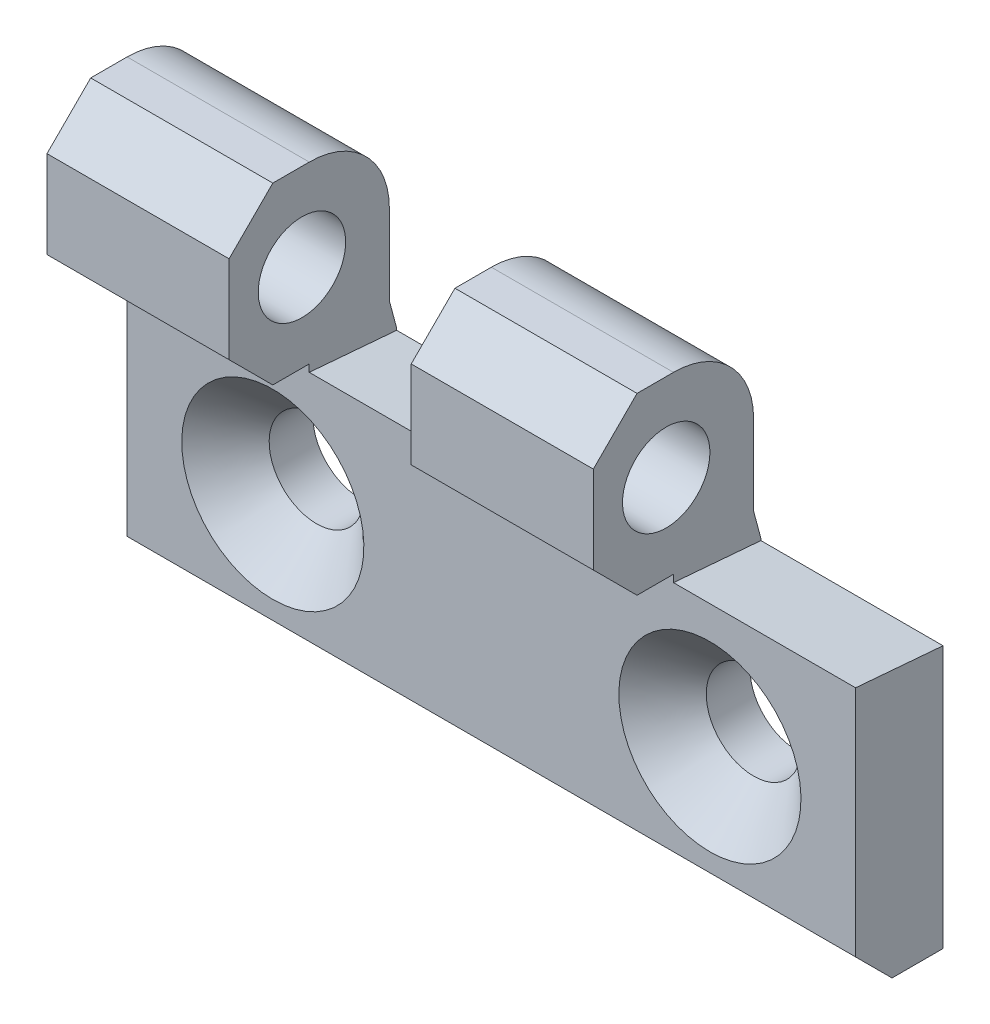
ISO-10303-21;
HEADER;
FILE_DESCRIPTION(('STEP AP214'),'2;1');
FILE_NAME('part.step','',(''),(''),'','','');
FILE_SCHEMA(('AUTOMOTIVE_DESIGN { 1 0 10303 214 1 1 1 1 }'));
ENDSEC;
DATA;
#1=APPLICATION_CONTEXT('core data for automotive mechanical design processes');
#2=APPLICATION_PROTOCOL_DEFINITION('international standard','automotive_design',2000,#1);
#3=PRODUCT_CONTEXT('',#1,'mechanical');
#4=PRODUCT('Part','Part','',(#3));
#5=PRODUCT_RELATED_PRODUCT_CATEGORY('part','',(#4));
#6=PRODUCT_DEFINITION_FORMATION('','',#4);
#7=PRODUCT_DEFINITION_CONTEXT('part definition',#1,'design');
#8=PRODUCT_DEFINITION('design','',#6,#7);
#9=PRODUCT_DEFINITION_SHAPE('','',#8);
#10=(LENGTH_UNIT() NAMED_UNIT(*) SI_UNIT(.MILLI.,.METRE.));
#11=(NAMED_UNIT(*) PLANE_ANGLE_UNIT() SI_UNIT($,.RADIAN.));
#12=(NAMED_UNIT(*) SI_UNIT($,.STERADIAN.) SOLID_ANGLE_UNIT());
#13=UNCERTAINTY_MEASURE_WITH_UNIT(LENGTH_MEASURE(1.E-05),#10,'distance_accuracy_value','');
#14=(GEOMETRIC_REPRESENTATION_CONTEXT(3) GLOBAL_UNCERTAINTY_ASSIGNED_CONTEXT((#13)) GLOBAL_UNIT_ASSIGNED_CONTEXT((#10,
#11,#12)) REPRESENTATION_CONTEXT('',''));
#15=CARTESIAN_POINT('',(0.,0.,0.));
#16=DIRECTION('',(0.,0.,1.));
#17=DIRECTION('',(1.,0.,0.));
#18=AXIS2_PLACEMENT_3D('',#15,#16,#17);
#19=CARTESIAN_POINT('',(-10.,8.,0.));
#20=DIRECTION('',(0.,0.99654575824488,-0.0830454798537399));
#21=DIRECTION('',(0.,0.0830454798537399,0.99654575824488));
#22=AXIS2_PLACEMENT_3D('',#19,#20,#21);
#23=PLANE('',#22);
#24=DIRECTION('',(0.,-0.0830454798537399,-0.99654575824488));
#25=VECTOR('',#24,1.);
#26=CARTESIAN_POINT('',(2.5,8.,0.));
#27=LINE('',#26,#25);
#28=CARTESIAN_POINT('',(2.5,8.5,6.));
#29=VERTEX_POINT('',#28);
#30=CARTESIAN_POINT('',(2.5,8.,0.));
#31=VERTEX_POINT('',#30);
#32=EDGE_CURVE('E29',#29,#31,#27,.T.);
#33=ORIENTED_EDGE('',*,*,#32,.F.);
#34=DIRECTION('',(1.,0.,0.));
#35=VECTOR('',#34,1.);
#36=CARTESIAN_POINT('',(-10.,8.5,6.));
#37=LINE('',#36,#35);
#38=CARTESIAN_POINT('',(15.,8.5,6.));
#39=VERTEX_POINT('',#38);
#40=EDGE_CURVE('E401',#29,#39,#37,.T.);
#41=ORIENTED_EDGE('',*,*,#40,.T.);
#42=DIRECTION('',(0.,-0.0830454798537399,-0.99654575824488));
#43=VECTOR('',#42,1.);
#44=CARTESIAN_POINT('',(15.,8.,0.));
#45=LINE('',#44,#43);
#46=CARTESIAN_POINT('',(15.,8.,0.));
#47=VERTEX_POINT('',#46);
#48=EDGE_CURVE('E367',#39,#47,#45,.T.);
#49=ORIENTED_EDGE('',*,*,#48,.T.);
#50=DIRECTION('',(1.,0.,0.));
#51=VECTOR('',#50,1.);
#52=CARTESIAN_POINT('',(-10.,8.,0.));
#53=LINE('',#52,#51);
#54=EDGE_CURVE('E22',#31,#47,#53,.T.);
#55=ORIENTED_EDGE('',*,*,#54,.F.);
#56=EDGE_LOOP('',(#33,#41,#49,#55));
#57=FACE_BOUND('',#56,.T.);
#58=ADVANCED_FACE('F14',(#57),#23,.T.);
#59=CARTESIAN_POINT('',(-10.,-10.,3.5));
#60=DIRECTION('',(0.,-1.,0.));
#61=DIRECTION('',(1.,0.,0.));
#62=AXIS2_PLACEMENT_3D('',#59,#60,#61);
#63=PLANE('',#62);
#64=DIRECTION('',(1.,0.,0.));
#65=VECTOR('',#64,1.);
#66=CARTESIAN_POINT('',(-10.,-10.,0.));
#67=LINE('',#66,#65);
#68=CARTESIAN_POINT('',(-10.,-10.,0.));
#69=VERTEX_POINT('',#68);
#70=CARTESIAN_POINT('',(40.,-10.,0.));
#71=VERTEX_POINT('',#70);
#72=EDGE_CURVE('E9',#69,#71,#67,.T.);
#73=ORIENTED_EDGE('',*,*,#72,.T.);
#74=DIRECTION('',(0.,0.,-1.));
#75=VECTOR('',#74,1.);
#76=CARTESIAN_POINT('',(40.,-10.,3.5));
#77=LINE('',#76,#75);
#78=CARTESIAN_POINT('',(40.,-10.,3.5));
#79=VERTEX_POINT('',#78);
#80=EDGE_CURVE('E372',#79,#71,#77,.T.);
#81=ORIENTED_EDGE('',*,*,#80,.F.);
#82=DIRECTION('',(1.,0.,0.));
#83=VECTOR('',#82,1.);
#84=CARTESIAN_POINT('',(-10.,-10.,3.5));
#85=LINE('',#84,#83);
#86=CARTESIAN_POINT('',(-10.,-10.,3.5));
#87=VERTEX_POINT('',#86);
#88=EDGE_CURVE('E394',#87,#79,#85,.T.);
#89=ORIENTED_EDGE('',*,*,#88,.F.);
#90=DIRECTION('',(0.,0.,-1.));
#91=VECTOR('',#90,1.);
#92=CARTESIAN_POINT('',(-10.,-10.,3.5));
#93=LINE('',#92,#91);
#94=EDGE_CURVE('E385',#87,#69,#93,.T.);
#95=ORIENTED_EDGE('',*,*,#94,.T.);
#96=EDGE_LOOP('',(#73,#81,#89,#95));
#97=FACE_BOUND('',#96,.T.);
#98=ADVANCED_FACE('F16',(#97),#63,.T.);
#99=CARTESIAN_POINT('',(-10.,-10.,0.));
#100=DIRECTION('',(0.,0.,-1.));
#101=DIRECTION('',(-1.,0.,0.));
#102=AXIS2_PLACEMENT_3D('',#99,#100,#101);
#103=PLANE('',#102);
#104=CARTESIAN_POINT('',(0.,0.,0.));
#105=DIRECTION('',(0.,0.,1.));
#106=DIRECTION('',(0.,-1.,0.));
#107=AXIS2_PLACEMENT_3D('',#104,#105,#106);
#108=CIRCLE('',#107,3.25);
#109=CARTESIAN_POINT('',(0.,-3.25,0.));
#110=VERTEX_POINT('',#109);
#111=EDGE_CURVE('E536',#110,#110,#108,.T.);
#112=ORIENTED_EDGE('',*,*,#111,.T.);
#113=EDGE_LOOP('',(#112));
#114=FACE_BOUND('',#113,.T.);
#115=CARTESIAN_POINT('',(30.,0.,0.));
#116=DIRECTION('',(0.,0.,1.));
#117=DIRECTION('',(0.,-1.,0.));
#118=AXIS2_PLACEMENT_3D('',#115,#116,#117);
#119=CIRCLE('',#118,3.25);
#120=CARTESIAN_POINT('',(30.,-3.25,0.));
#121=VERTEX_POINT('',#120);
#122=EDGE_CURVE('E539',#121,#121,#119,.T.);
#123=ORIENTED_EDGE('',*,*,#122,.T.);
#124=EDGE_LOOP('',(#123));
#125=FACE_BOUND('',#124,.T.);
#126=DIRECTION('',(0.,1.,0.));
#127=VECTOR('',#126,1.);
#128=CARTESIAN_POINT('',(-10.,-10.,0.));
#129=LINE('',#128,#127);
#130=CARTESIAN_POINT('',(-10.,8.1339745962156,0.));
#131=VERTEX_POINT('',#130);
#132=EDGE_CURVE('E192',#69,#131,#129,.T.);
#133=ORIENTED_EDGE('',*,*,#132,.T.);
#134=DIRECTION('',(1.,0.,0.));
#135=VECTOR('',#134,1.);
#136=CARTESIAN_POINT('',(-10.,8.1339745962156,0.));
#137=LINE('',#136,#135);
#138=CARTESIAN_POINT('',(2.5,8.1339745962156,0.));
#139=VERTEX_POINT('',#138);
#140=EDGE_CURVE('E189',#131,#139,#137,.T.);
#141=ORIENTED_EDGE('',*,*,#140,.T.);
#142=DIRECTION('',(0.,1.,0.));
#143=VECTOR('',#142,1.);
#144=CARTESIAN_POINT('',(2.5,3.,0.));
#145=LINE('',#144,#143);
#146=EDGE_CURVE('E178',#31,#139,#145,.T.);
#147=ORIENTED_EDGE('',*,*,#146,.F.);
#148=ORIENTED_EDGE('',*,*,#54,.T.);
#149=DIRECTION('',(0.,1.,0.));
#150=VECTOR('',#149,1.);
#151=CARTESIAN_POINT('',(15.,3.,0.));
#152=LINE('',#151,#150);
#153=CARTESIAN_POINT('',(15.,8.1339745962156,0.));
#154=VERTEX_POINT('',#153);
#155=EDGE_CURVE('E282',#47,#154,#152,.T.);
#156=ORIENTED_EDGE('',*,*,#155,.T.);
#157=DIRECTION('',(-1.,0.,0.));
#158=VECTOR('',#157,1.);
#159=CARTESIAN_POINT('',(27.5,8.1339745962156,0.));
#160=LINE('',#159,#158);
#161=CARTESIAN_POINT('',(27.5,8.1339745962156,0.));
#162=VERTEX_POINT('',#161);
#163=EDGE_CURVE('E364',#162,#154,#160,.T.);
#164=ORIENTED_EDGE('',*,*,#163,.F.);
#165=DIRECTION('',(0.,1.,0.));
#166=VECTOR('',#165,1.);
#167=CARTESIAN_POINT('',(27.5,3.,0.));
#168=LINE('',#167,#166);
#169=CARTESIAN_POINT('',(27.5,8.,0.));
#170=VERTEX_POINT('',#169);
#171=EDGE_CURVE('E317',#170,#162,#168,.T.);
#172=ORIENTED_EDGE('',*,*,#171,.F.);
#173=CARTESIAN_POINT('',(40.,8.,0.));
#174=VERTEX_POINT('',#173);
#175=EDGE_CURVE('E402',#170,#174,#53,.T.);
#176=ORIENTED_EDGE('',*,*,#175,.T.);
#177=DIRECTION('',(0.,1.,0.));
#178=VECTOR('',#177,1.);
#179=CARTESIAN_POINT('',(40.,-10.,0.));
#180=LINE('',#179,#178);
#181=EDGE_CURVE('E373',#71,#174,#180,.T.);
#182=ORIENTED_EDGE('',*,*,#181,.F.);
#183=ORIENTED_EDGE('',*,*,#72,.F.);
#184=EDGE_LOOP('',(#133,#141,#147,#148,#156,#164,#172,#176,#182,#183));
#185=FACE_BOUND('',#184,.T.);
#186=ADVANCED_FACE('F190',(#114,#125,#185),#103,.T.);
#187=DIRECTION('',(0.,-0.0830454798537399,-0.99654575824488));
#188=VECTOR('',#187,1.);
#189=CARTESIAN_POINT('',(27.5,8.,0.));
#190=LINE('',#189,#188);
#191=CARTESIAN_POINT('',(27.5,8.5,6.));
#192=VERTEX_POINT('',#191);
#193=EDGE_CURVE('E370',#192,#170,#190,.T.);
#194=ORIENTED_EDGE('',*,*,#193,.F.);
#195=CARTESIAN_POINT('',(40.,8.5,6.));
#196=VERTEX_POINT('',#195);
#197=EDGE_CURVE('E400',#192,#196,#37,.T.);
#198=ORIENTED_EDGE('',*,*,#197,.T.);
#199=DIRECTION('',(0.,0.0830454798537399,0.99654575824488));
#200=VECTOR('',#199,1.);
#201=CARTESIAN_POINT('',(40.,8.,0.));
#202=LINE('',#201,#200);
#203=EDGE_CURVE('E376',#174,#196,#202,.T.);
#204=ORIENTED_EDGE('',*,*,#203,.F.);
#205=ORIENTED_EDGE('',*,*,#175,.F.);
#206=EDGE_LOOP('',(#194,#198,#204,#205));
#207=FACE_BOUND('',#206,.T.);
#208=ADVANCED_FACE('F414',(#207),#23,.T.);
#209=CARTESIAN_POINT('',(-10.,8.5,6.));
#210=DIRECTION('',(0.,0.,1.));
#211=DIRECTION('',(1.,0.,0.));
#212=AXIS2_PLACEMENT_3D('',#209,#210,#211);
#213=PLANE('',#212);
#214=CARTESIAN_POINT('',(0.,0.,6.));
#215=DIRECTION('',(0.,0.,1.));
#216=DIRECTION('',(0.,-1.,0.));
#217=AXIS2_PLACEMENT_3D('',#214,#215,#216);
#218=CIRCLE('',#217,6.25);
#219=CARTESIAN_POINT('',(0.,-6.25,6.));
#220=VERTEX_POINT('',#219);
#221=EDGE_CURVE('E542',#220,#220,#218,.T.);
#222=ORIENTED_EDGE('',*,*,#221,.F.);
#223=EDGE_LOOP('',(#222));
#224=FACE_BOUND('',#223,.T.);
#225=CARTESIAN_POINT('',(30.,0.,6.));
#226=DIRECTION('',(0.,0.,1.));
#227=DIRECTION('',(0.,-1.,0.));
#228=AXIS2_PLACEMENT_3D('',#225,#226,#227);
#229=CIRCLE('',#228,6.25);
#230=CARTESIAN_POINT('',(30.,-6.25,6.));
#231=VERTEX_POINT('',#230);
#232=EDGE_CURVE('E186',#231,#231,#229,.T.);
#233=ORIENTED_EDGE('',*,*,#232,.F.);
#234=EDGE_LOOP('',(#233));
#235=FACE_BOUND('',#234,.T.);
#236=DIRECTION('',(0.,-1.,0.));
#237=VECTOR('',#236,1.);
#238=CARTESIAN_POINT('',(-10.,8.5,6.));
#239=LINE('',#238,#237);
#240=CARTESIAN_POINT('',(-10.,9.,6.));
#241=VERTEX_POINT('',#240);
#242=CARTESIAN_POINT('',(-10.,-7.5,6.));
#243=VERTEX_POINT('',#242);
#244=EDGE_CURVE('E389',#241,#243,#239,.T.);
#245=ORIENTED_EDGE('',*,*,#244,.T.);
#246=DIRECTION('',(1.,0.,0.));
#247=VECTOR('',#246,1.);
#248=CARTESIAN_POINT('',(-10.,-7.5,6.));
#249=LINE('',#248,#247);
#250=CARTESIAN_POINT('',(40.,-7.5,6.));
#251=VERTEX_POINT('',#250);
#252=EDGE_CURVE('E398',#243,#251,#249,.T.);
#253=ORIENTED_EDGE('',*,*,#252,.T.);
#254=DIRECTION('',(0.,-1.,0.));
#255=VECTOR('',#254,1.);
#256=CARTESIAN_POINT('',(40.,8.5,6.));
#257=LINE('',#256,#255);
#258=EDGE_CURVE('E379',#196,#251,#257,.T.);
#259=ORIENTED_EDGE('',*,*,#258,.F.);
#260=ORIENTED_EDGE('',*,*,#197,.F.);
#261=DIRECTION('',(0.,-1.,0.));
#262=VECTOR('',#261,1.);
#263=CARTESIAN_POINT('',(27.5,9.,6.));
#264=LINE('',#263,#262);
#265=CARTESIAN_POINT('',(27.5,9.,6.));
#266=VERTEX_POINT('',#265);
#267=EDGE_CURVE('E335',#266,#192,#264,.T.);
#268=ORIENTED_EDGE('',*,*,#267,.F.);
#269=DIRECTION('',(-1.,0.,0.));
#270=VECTOR('',#269,1.);
#271=CARTESIAN_POINT('',(27.5,9.,6.));
#272=LINE('',#271,#270);
#273=CARTESIAN_POINT('',(15.,9.,6.));
#274=VERTEX_POINT('',#273);
#275=EDGE_CURVE('E340',#266,#274,#272,.T.);
#276=ORIENTED_EDGE('',*,*,#275,.T.);
#277=DIRECTION('',(0.,-1.,0.));
#278=VECTOR('',#277,1.);
#279=CARTESIAN_POINT('',(15.,9.,6.));
#280=LINE('',#279,#278);
#281=EDGE_CURVE('E309',#274,#39,#280,.T.);
#282=ORIENTED_EDGE('',*,*,#281,.T.);
#283=ORIENTED_EDGE('',*,*,#40,.F.);
#284=DIRECTION('',(0.,-1.,0.));
#285=VECTOR('',#284,1.);
#286=CARTESIAN_POINT('',(2.5,9.,6.));
#287=LINE('',#286,#285);
#288=CARTESIAN_POINT('',(2.5,9.,6.));
#289=VERTEX_POINT('',#288);
#290=EDGE_CURVE('E233',#289,#29,#287,.T.);
#291=ORIENTED_EDGE('',*,*,#290,.F.);
#292=DIRECTION('',(1.,0.,0.));
#293=VECTOR('',#292,1.);
#294=CARTESIAN_POINT('',(-10.,9.,6.));
#295=LINE('',#294,#293);
#296=EDGE_CURVE('E266',#241,#289,#295,.T.);
#297=ORIENTED_EDGE('',*,*,#296,.F.);
#298=EDGE_LOOP('',(#245,#253,#259,#260,#268,#276,#282,#283,#291,#297));
#299=FACE_BOUND('',#298,.T.);
#300=ADVANCED_FACE('F418',(#224,#235,#299),#213,.T.);
#301=CARTESIAN_POINT('',(-10.,-7.5,6.));
#302=DIRECTION('',(0.,-0.707106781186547,0.707106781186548));
#303=DIRECTION('',(0.,-0.707106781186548,-0.707106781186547));
#304=AXIS2_PLACEMENT_3D('',#301,#302,#303);
#305=PLANE('',#304);
#306=ORIENTED_EDGE('',*,*,#88,.T.);
#307=DIRECTION('',(0.,-0.707106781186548,-0.707106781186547));
#308=VECTOR('',#307,1.);
#309=CARTESIAN_POINT('',(40.,-7.5,6.));
#310=LINE('',#309,#308);
#311=EDGE_CURVE('E382',#251,#79,#310,.T.);
#312=ORIENTED_EDGE('',*,*,#311,.F.);
#313=ORIENTED_EDGE('',*,*,#252,.F.);
#314=DIRECTION('',(0.,-0.707106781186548,-0.707106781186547));
#315=VECTOR('',#314,1.);
#316=CARTESIAN_POINT('',(-10.,-7.5,6.));
#317=LINE('',#316,#315);
#318=EDGE_CURVE('E391',#243,#87,#317,.T.);
#319=ORIENTED_EDGE('',*,*,#318,.T.);
#320=EDGE_LOOP('',(#306,#312,#313,#319));
#321=FACE_BOUND('',#320,.T.);
#322=ADVANCED_FACE('F422',(#321),#305,.T.);
#323=CARTESIAN_POINT('',(-10.,-10.,0.));
#324=DIRECTION('',(1.,0.,0.));
#325=DIRECTION('',(0.,1.,0.));
#326=AXIS2_PLACEMENT_3D('',#323,#324,#325);
#327=PLANE('',#326);
#328=ORIENTED_EDGE('',*,*,#318,.F.);
#329=ORIENTED_EDGE('',*,*,#244,.F.);
#330=DIRECTION('',(0.,0.,-1.));
#331=VECTOR('',#330,1.);
#332=CARTESIAN_POINT('',(-10.,9.,8.5));
#333=LINE('',#332,#331);
#334=CARTESIAN_POINT('',(-10.,9.,8.5));
#335=VERTEX_POINT('',#334);
#336=EDGE_CURVE('E260',#335,#241,#333,.T.);
#337=ORIENTED_EDGE('',*,*,#336,.F.);
#338=DIRECTION('',(0.,-0.707106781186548,-0.707106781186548));
#339=VECTOR('',#338,1.);
#340=CARTESIAN_POINT('',(-10.,12.,11.5));
#341=LINE('',#340,#339);
#342=CARTESIAN_POINT('',(-10.,12.,11.5));
#343=VERTEX_POINT('',#342);
#344=EDGE_CURVE('E257',#343,#335,#341,.T.);
#345=ORIENTED_EDGE('',*,*,#344,.F.);
#346=DIRECTION('',(0.,-1.,0.));
#347=VECTOR('',#346,1.);
#348=CARTESIAN_POINT('',(-10.,18.,11.5));
#349=LINE('',#348,#347);
#350=CARTESIAN_POINT('',(-10.,18.,11.5));
#351=VERTEX_POINT('',#350);
#352=EDGE_CURVE('E254',#351,#343,#349,.T.);
#353=ORIENTED_EDGE('',*,*,#352,.F.);
#354=DIRECTION('',(0.,-0.707106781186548,0.707106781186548));
#355=VECTOR('',#354,1.);
#356=CARTESIAN_POINT('',(-10.,21.,8.5));
#357=LINE('',#356,#355);
#358=CARTESIAN_POINT('',(-10.,21.,8.5));
#359=VERTEX_POINT('',#358);
#360=EDGE_CURVE('E251',#359,#351,#357,.T.);
#361=ORIENTED_EDGE('',*,*,#360,.F.);
#362=DIRECTION('',(0.,0.,1.));
#363=VECTOR('',#362,1.);
#364=CARTESIAN_POINT('',(-10.,21.,6.));
#365=LINE('',#364,#363);
#366=CARTESIAN_POINT('',(-10.,21.,6.));
#367=VERTEX_POINT('',#366);
#368=EDGE_CURVE('E248',#367,#359,#365,.T.);
#369=ORIENTED_EDGE('',*,*,#368,.F.);
#370=CARTESIAN_POINT('',(-10.,15.5,6.));
#371=DIRECTION('',(1.,0.,0.));
#372=DIRECTION('',(0.,-1.,0.));
#373=AXIS2_PLACEMENT_3D('',#370,#371,#372);
#374=CIRCLE('',#373,5.5);
#375=CARTESIAN_POINT('',(-10.,15.5,0.5));
#376=VERTEX_POINT('',#375);
#377=EDGE_CURVE('E245',#376,#367,#374,.T.);
#378=ORIENTED_EDGE('',*,*,#377,.F.);
#379=DIRECTION('',(0.,1.,0.));
#380=VECTOR('',#379,1.);
#381=CARTESIAN_POINT('',(-10.,10.,0.5));
#382=LINE('',#381,#380);
#383=CARTESIAN_POINT('',(-10.,10.,0.5));
#384=VERTEX_POINT('',#383);
#385=EDGE_CURVE('E242',#384,#376,#382,.T.);
#386=ORIENTED_EDGE('',*,*,#385,.F.);
#387=DIRECTION('',(0.,0.965925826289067,0.258819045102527));
#388=VECTOR('',#387,1.);
#389=CARTESIAN_POINT('',(-10.,8.1339745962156,0.));
#390=LINE('',#389,#388);
#391=EDGE_CURVE('E240',#131,#384,#390,.T.);
#392=ORIENTED_EDGE('',*,*,#391,.F.);
#393=ORIENTED_EDGE('',*,*,#132,.F.);
#394=ORIENTED_EDGE('',*,*,#94,.F.);
#395=EDGE_LOOP('',(#328,#329,#337,#345,#353,#361,#369,#378,#386,#392,#393,#394));
#396=FACE_BOUND('',#395,.T.);
#397=CARTESIAN_POINT('',(-10.,15.,6.5));
#398=DIRECTION('',(1.,0.,0.));
#399=DIRECTION('',(0.,1.,0.));
#400=AXIS2_PLACEMENT_3D('',#397,#398,#399);
#401=CIRCLE('',#400,3.);
#402=CARTESIAN_POINT('',(-10.,18.,6.5));
#403=VERTEX_POINT('',#402);
#404=EDGE_CURVE('E263',#403,#403,#401,.T.);
#405=ORIENTED_EDGE('',*,*,#404,.T.);
#406=EDGE_LOOP('',(#405));
#407=FACE_BOUND('',#406,.T.);
#408=ADVANCED_FACE('F427',(#396,#407),#327,.F.);
#409=CARTESIAN_POINT('',(40.,-10.,0.));
#410=DIRECTION('',(1.,0.,0.));
#411=DIRECTION('',(0.,1.,0.));
#412=AXIS2_PLACEMENT_3D('',#409,#410,#411);
#413=PLANE('',#412);
#414=ORIENTED_EDGE('',*,*,#80,.T.);
#415=ORIENTED_EDGE('',*,*,#181,.T.);
#416=ORIENTED_EDGE('',*,*,#203,.T.);
#417=ORIENTED_EDGE('',*,*,#258,.T.);
#418=ORIENTED_EDGE('',*,*,#311,.T.);
#419=EDGE_LOOP('',(#414,#415,#416,#417,#418));
#420=FACE_BOUND('',#419,.T.);
#421=ADVANCED_FACE('F411',(#420),#413,.T.);
#422=CARTESIAN_POINT('',(27.5,8.1339745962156,0.));
#423=DIRECTION('',(0.,-0.258819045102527,0.965925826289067));
#424=DIRECTION('',(0.,-0.965925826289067,-0.258819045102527));
#425=AXIS2_PLACEMENT_3D('',#422,#423,#424);
#426=PLANE('',#425);
#427=DIRECTION('',(0.,0.965925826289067,0.258819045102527));
#428=VECTOR('',#427,1.);
#429=CARTESIAN_POINT('',(15.,8.1339745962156,0.));
#430=LINE('',#429,#428);
#431=CARTESIAN_POINT('',(15.,10.,0.5));
#432=VERTEX_POINT('',#431);
#433=EDGE_CURVE('E285',#154,#432,#430,.T.);
#434=ORIENTED_EDGE('',*,*,#433,.T.);
#435=DIRECTION('',(-1.,0.,0.));
#436=VECTOR('',#435,1.);
#437=CARTESIAN_POINT('',(27.5,10.,0.5));
#438=LINE('',#437,#436);
#439=CARTESIAN_POINT('',(27.5,10.,0.5));
#440=VERTEX_POINT('',#439);
#441=EDGE_CURVE('E361',#440,#432,#438,.T.);
#442=ORIENTED_EDGE('',*,*,#441,.F.);
#443=DIRECTION('',(0.,0.965925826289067,0.258819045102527));
#444=VECTOR('',#443,1.);
#445=CARTESIAN_POINT('',(27.5,8.1339745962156,0.));
#446=LINE('',#445,#444);
#447=EDGE_CURVE('E319',#162,#440,#446,.T.);
#448=ORIENTED_EDGE('',*,*,#447,.F.);
#449=ORIENTED_EDGE('',*,*,#163,.T.);
#450=EDGE_LOOP('',(#434,#442,#448,#449));
#451=FACE_BOUND('',#450,.T.);
#452=ADVANCED_FACE('F468',(#451),#426,.F.);
#453=CARTESIAN_POINT('',(27.5,10.,0.5));
#454=DIRECTION('',(0.,0.,1.));
#455=DIRECTION('',(1.,0.,0.));
#456=AXIS2_PLACEMENT_3D('',#453,#454,#455);
#457=PLANE('',#456);
#458=DIRECTION('',(0.,1.,0.));
#459=VECTOR('',#458,1.);
#460=CARTESIAN_POINT('',(15.,10.,0.5));
#461=LINE('',#460,#459);
#462=CARTESIAN_POINT('',(15.,15.5,0.5));
#463=VERTEX_POINT('',#462);
#464=EDGE_CURVE('E288',#432,#463,#461,.T.);
#465=ORIENTED_EDGE('',*,*,#464,.T.);
#466=DIRECTION('',(-1.,0.,0.));
#467=VECTOR('',#466,1.);
#468=CARTESIAN_POINT('',(27.5,15.5,0.5));
#469=LINE('',#468,#467);
#470=CARTESIAN_POINT('',(27.5,15.5,0.5));
#471=VERTEX_POINT('',#470);
#472=EDGE_CURVE('E358',#471,#463,#469,.T.);
#473=ORIENTED_EDGE('',*,*,#472,.F.);
#474=DIRECTION('',(0.,1.,0.));
#475=VECTOR('',#474,1.);
#476=CARTESIAN_POINT('',(27.5,10.,0.5));
#477=LINE('',#476,#475);
#478=EDGE_CURVE('E321',#440,#471,#477,.T.);
#479=ORIENTED_EDGE('',*,*,#478,.F.);
#480=ORIENTED_EDGE('',*,*,#441,.T.);
#481=EDGE_LOOP('',(#465,#473,#479,#480));
#482=FACE_BOUND('',#481,.T.);
#483=ADVANCED_FACE('F504',(#482),#457,.F.);
#484=CARTESIAN_POINT('',(27.5,15.5,6.));
#485=DIRECTION('',(-1.,0.,0.));
#486=DIRECTION('',(0.,-1.,0.));
#487=AXIS2_PLACEMENT_3D('',#484,#485,#486);
#488=CYLINDRICAL_SURFACE('',#487,5.5);
#489=CARTESIAN_POINT('',(15.,15.5,6.));
#490=DIRECTION('',(1.,0.,0.));
#491=DIRECTION('',(0.,-1.,0.));
#492=AXIS2_PLACEMENT_3D('',#489,#490,#491);
#493=CIRCLE('',#492,5.5);
#494=CARTESIAN_POINT('',(15.,21.,6.));
#495=VERTEX_POINT('',#494);
#496=EDGE_CURVE('E291',#463,#495,#493,.T.);
#497=ORIENTED_EDGE('',*,*,#496,.T.);
#498=DIRECTION('',(-1.,0.,0.));
#499=VECTOR('',#498,1.);
#500=CARTESIAN_POINT('',(27.5,21.,6.));
#501=LINE('',#500,#499);
#502=CARTESIAN_POINT('',(27.5,21.,6.));
#503=VERTEX_POINT('',#502);
#504=EDGE_CURVE('E355',#503,#495,#501,.T.);
#505=ORIENTED_EDGE('',*,*,#504,.F.);
#506=CARTESIAN_POINT('',(27.5,15.5,6.));
#507=DIRECTION('',(1.,0.,0.));
#508=DIRECTION('',(0.,-1.,0.));
#509=AXIS2_PLACEMENT_3D('',#506,#507,#508);
#510=CIRCLE('',#509,5.5);
#511=EDGE_CURVE('E323',#471,#503,#510,.T.);
#512=ORIENTED_EDGE('',*,*,#511,.F.);
#513=ORIENTED_EDGE('',*,*,#472,.T.);
#514=EDGE_LOOP('',(#497,#505,#512,#513));
#515=FACE_BOUND('',#514,.T.);
#516=ADVANCED_FACE('F502',(#515),#488,.T.);
#517=CARTESIAN_POINT('',(27.5,21.,6.));
#518=DIRECTION('',(0.,-1.,0.));
#519=DIRECTION('',(1.,0.,0.));
#520=AXIS2_PLACEMENT_3D('',#517,#518,#519);
#521=PLANE('',#520);
#522=DIRECTION('',(0.,0.,1.));
#523=VECTOR('',#522,1.);
#524=CARTESIAN_POINT('',(15.,21.,6.));
#525=LINE('',#524,#523);
#526=CARTESIAN_POINT('',(15.,21.,8.5));
#527=VERTEX_POINT('',#526);
#528=EDGE_CURVE('E294',#495,#527,#525,.T.);
#529=ORIENTED_EDGE('',*,*,#528,.T.);
#530=DIRECTION('',(-1.,0.,0.));
#531=VECTOR('',#530,1.);
#532=CARTESIAN_POINT('',(27.5,21.,8.5));
#533=LINE('',#532,#531);
#534=CARTESIAN_POINT('',(27.5,21.,8.5));
#535=VERTEX_POINT('',#534);
#536=EDGE_CURVE('E352',#535,#527,#533,.T.);
#537=ORIENTED_EDGE('',*,*,#536,.F.);
#538=DIRECTION('',(0.,0.,1.));
#539=VECTOR('',#538,1.);
#540=CARTESIAN_POINT('',(27.5,21.,6.));
#541=LINE('',#540,#539);
#542=EDGE_CURVE('E325',#503,#535,#541,.T.);
#543=ORIENTED_EDGE('',*,*,#542,.F.);
#544=ORIENTED_EDGE('',*,*,#504,.T.);
#545=EDGE_LOOP('',(#529,#537,#543,#544));
#546=FACE_BOUND('',#545,.T.);
#547=ADVANCED_FACE('F497',(#546),#521,.F.);
#548=CARTESIAN_POINT('',(27.5,21.,8.5));
#549=DIRECTION('',(0.,-0.707106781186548,-0.707106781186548));
#550=DIRECTION('',(0.,0.707106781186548,-0.707106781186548));
#551=AXIS2_PLACEMENT_3D('',#548,#549,#550);
#552=PLANE('',#551);
#553=DIRECTION('',(0.,-0.707106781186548,0.707106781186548));
#554=VECTOR('',#553,1.);
#555=CARTESIAN_POINT('',(15.,21.,8.5));
#556=LINE('',#555,#554);
#557=CARTESIAN_POINT('',(15.,18.,11.5));
#558=VERTEX_POINT('',#557);
#559=EDGE_CURVE('E297',#527,#558,#556,.T.);
#560=ORIENTED_EDGE('',*,*,#559,.T.);
#561=DIRECTION('',(-1.,0.,0.));
#562=VECTOR('',#561,1.);
#563=CARTESIAN_POINT('',(27.5,18.,11.5));
#564=LINE('',#563,#562);
#565=CARTESIAN_POINT('',(27.5,18.,11.5));
#566=VERTEX_POINT('',#565);
#567=EDGE_CURVE('E349',#566,#558,#564,.T.);
#568=ORIENTED_EDGE('',*,*,#567,.F.);
#569=DIRECTION('',(0.,-0.707106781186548,0.707106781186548));
#570=VECTOR('',#569,1.);
#571=CARTESIAN_POINT('',(27.5,21.,8.5));
#572=LINE('',#571,#570);
#573=EDGE_CURVE('E327',#535,#566,#572,.T.);
#574=ORIENTED_EDGE('',*,*,#573,.F.);
#575=ORIENTED_EDGE('',*,*,#536,.T.);
#576=EDGE_LOOP('',(#560,#568,#574,#575));
#577=FACE_BOUND('',#576,.T.);
#578=ADVANCED_FACE('F492',(#577),#552,.F.);
#579=CARTESIAN_POINT('',(27.5,18.,11.5));
#580=DIRECTION('',(0.,0.,-1.));
#581=DIRECTION('',(-1.,0.,0.));
#582=AXIS2_PLACEMENT_3D('',#579,#580,#581);
#583=PLANE('',#582);
#584=DIRECTION('',(0.,-1.,0.));
#585=VECTOR('',#584,1.);
#586=CARTESIAN_POINT('',(15.,18.,11.5));
#587=LINE('',#586,#585);
#588=CARTESIAN_POINT('',(15.,12.,11.5));
#589=VERTEX_POINT('',#588);
#590=EDGE_CURVE('E300',#558,#589,#587,.T.);
#591=ORIENTED_EDGE('',*,*,#590,.T.);
#592=DIRECTION('',(-1.,0.,0.));
#593=VECTOR('',#592,1.);
#594=CARTESIAN_POINT('',(27.5,12.,11.5));
#595=LINE('',#594,#593);
#596=CARTESIAN_POINT('',(27.5,12.,11.5));
#597=VERTEX_POINT('',#596);
#598=EDGE_CURVE('E346',#597,#589,#595,.T.);
#599=ORIENTED_EDGE('',*,*,#598,.F.);
#600=DIRECTION('',(0.,-1.,0.));
#601=VECTOR('',#600,1.);
#602=CARTESIAN_POINT('',(27.5,18.,11.5));
#603=LINE('',#602,#601);
#604=EDGE_CURVE('E329',#566,#597,#603,.T.);
#605=ORIENTED_EDGE('',*,*,#604,.F.);
#606=ORIENTED_EDGE('',*,*,#567,.T.);
#607=EDGE_LOOP('',(#591,#599,#605,#606));
#608=FACE_BOUND('',#607,.T.);
#609=ADVANCED_FACE('F488',(#608),#583,.F.);
#610=CARTESIAN_POINT('',(27.5,12.,11.5));
#611=DIRECTION('',(0.,0.707106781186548,-0.707106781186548));
#612=DIRECTION('',(0.,0.707106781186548,0.707106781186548));
#613=AXIS2_PLACEMENT_3D('',#610,#611,#612);
#614=PLANE('',#613);
#615=DIRECTION('',(0.,-0.707106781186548,-0.707106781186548));
#616=VECTOR('',#615,1.);
#617=CARTESIAN_POINT('',(15.,12.,11.5));
#618=LINE('',#617,#616);
#619=CARTESIAN_POINT('',(15.,9.,8.5));
#620=VERTEX_POINT('',#619);
#621=EDGE_CURVE('E303',#589,#620,#618,.T.);
#622=ORIENTED_EDGE('',*,*,#621,.T.);
#623=DIRECTION('',(-1.,0.,0.));
#624=VECTOR('',#623,1.);
#625=CARTESIAN_POINT('',(27.5,9.,8.5));
#626=LINE('',#625,#624);
#627=CARTESIAN_POINT('',(27.5,9.,8.5));
#628=VERTEX_POINT('',#627);
#629=EDGE_CURVE('E343',#628,#620,#626,.T.);
#630=ORIENTED_EDGE('',*,*,#629,.F.);
#631=DIRECTION('',(0.,-0.707106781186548,-0.707106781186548));
#632=VECTOR('',#631,1.);
#633=CARTESIAN_POINT('',(27.5,12.,11.5));
#634=LINE('',#633,#632);
#635=EDGE_CURVE('E331',#597,#628,#634,.T.);
#636=ORIENTED_EDGE('',*,*,#635,.F.);
#637=ORIENTED_EDGE('',*,*,#598,.T.);
#638=EDGE_LOOP('',(#622,#630,#636,#637));
#639=FACE_BOUND('',#638,.T.);
#640=ADVANCED_FACE('F484',(#639),#614,.F.);
#641=CARTESIAN_POINT('',(27.5,9.,8.5));
#642=DIRECTION('',(0.,1.,0.));
#643=DIRECTION('',(-1.,0.,0.));
#644=AXIS2_PLACEMENT_3D('',#641,#642,#643);
#645=PLANE('',#644);
#646=DIRECTION('',(0.,0.,-1.));
#647=VECTOR('',#646,1.);
#648=CARTESIAN_POINT('',(15.,9.,8.5));
#649=LINE('',#648,#647);
#650=EDGE_CURVE('E306',#620,#274,#649,.T.);
#651=ORIENTED_EDGE('',*,*,#650,.T.);
#652=ORIENTED_EDGE('',*,*,#275,.F.);
#653=DIRECTION('',(0.,0.,-1.));
#654=VECTOR('',#653,1.);
#655=CARTESIAN_POINT('',(27.5,9.,8.5));
#656=LINE('',#655,#654);
#657=EDGE_CURVE('E333',#628,#266,#656,.T.);
#658=ORIENTED_EDGE('',*,*,#657,.F.);
#659=ORIENTED_EDGE('',*,*,#629,.T.);
#660=EDGE_LOOP('',(#651,#652,#658,#659));
#661=FACE_BOUND('',#660,.T.);
#662=ADVANCED_FACE('F479',(#661),#645,.F.);
#663=CARTESIAN_POINT('',(27.5,15.,6.5));
#664=DIRECTION('',(-1.,0.,0.));
#665=DIRECTION('',(0.,-1.,0.));
#666=AXIS2_PLACEMENT_3D('',#663,#664,#665);
#667=CYLINDRICAL_SURFACE('',#666,3.);
#668=CARTESIAN_POINT('',(27.5,15.,6.5));
#669=DIRECTION('',(1.,0.,0.));
#670=DIRECTION('',(0.,1.,0.));
#671=AXIS2_PLACEMENT_3D('',#668,#669,#670);
#672=CIRCLE('',#671,3.);
#673=CARTESIAN_POINT('',(27.5,18.,6.5));
#674=VERTEX_POINT('',#673);
#675=EDGE_CURVE('E337',#674,#674,#672,.T.);
#676=ORIENTED_EDGE('',*,*,#675,.T.);
#677=EDGE_LOOP('',(#676));
#678=FACE_BOUND('',#677,.T.);
#679=CARTESIAN_POINT('',(15.,15.,6.5));
#680=DIRECTION('',(1.,0.,0.));
#681=DIRECTION('',(0.,1.,0.));
#682=AXIS2_PLACEMENT_3D('',#679,#680,#681);
#683=CIRCLE('',#682,3.);
#684=CARTESIAN_POINT('',(15.,18.,6.5));
#685=VERTEX_POINT('',#684);
#686=EDGE_CURVE('E313',#685,#685,#683,.T.);
#687=ORIENTED_EDGE('',*,*,#686,.F.);
#688=EDGE_LOOP('',(#687));
#689=FACE_BOUND('',#688,.T.);
#690=ADVANCED_FACE('F595',(#678,#689),#667,.F.);
#691=CARTESIAN_POINT('',(27.5,15.5,6.));
#692=DIRECTION('',(1.,0.,0.));
#693=DIRECTION('',(0.,1.,0.));
#694=AXIS2_PLACEMENT_3D('',#691,#692,#693);
#695=PLANE('',#694);
#696=ORIENTED_EDGE('',*,*,#675,.F.);
#697=EDGE_LOOP('',(#696));
#698=FACE_BOUND('',#697,.T.);
#699=ORIENTED_EDGE('',*,*,#267,.T.);
#700=ORIENTED_EDGE('',*,*,#193,.T.);
#701=ORIENTED_EDGE('',*,*,#171,.T.);
#702=ORIENTED_EDGE('',*,*,#447,.T.);
#703=ORIENTED_EDGE('',*,*,#478,.T.);
#704=ORIENTED_EDGE('',*,*,#511,.T.);
#705=ORIENTED_EDGE('',*,*,#542,.T.);
#706=ORIENTED_EDGE('',*,*,#573,.T.);
#707=ORIENTED_EDGE('',*,*,#604,.T.);
#708=ORIENTED_EDGE('',*,*,#635,.T.);
#709=ORIENTED_EDGE('',*,*,#657,.T.);
#710=EDGE_LOOP('',(#699,#700,#701,#702,#703,#704,#705,#706,#707,#708,#709));
#711=FACE_BOUND('',#710,.T.);
#712=ADVANCED_FACE('F472',(#698,#711),#695,.T.);
#713=CARTESIAN_POINT('',(15.,15.5,6.));
#714=DIRECTION('',(1.,0.,0.));
#715=DIRECTION('',(0.,1.,0.));
#716=AXIS2_PLACEMENT_3D('',#713,#714,#715);
#717=PLANE('',#716);
#718=ORIENTED_EDGE('',*,*,#48,.F.);
#719=ORIENTED_EDGE('',*,*,#281,.F.);
#720=ORIENTED_EDGE('',*,*,#650,.F.);
#721=ORIENTED_EDGE('',*,*,#621,.F.);
#722=ORIENTED_EDGE('',*,*,#590,.F.);
#723=ORIENTED_EDGE('',*,*,#559,.F.);
#724=ORIENTED_EDGE('',*,*,#528,.F.);
#725=ORIENTED_EDGE('',*,*,#496,.F.);
#726=ORIENTED_EDGE('',*,*,#464,.F.);
#727=ORIENTED_EDGE('',*,*,#433,.F.);
#728=ORIENTED_EDGE('',*,*,#155,.F.);
#729=EDGE_LOOP('',(#718,#719,#720,#721,#722,#723,#724,#725,#726,#727,#728));
#730=FACE_BOUND('',#729,.T.);
#731=ORIENTED_EDGE('',*,*,#686,.T.);
#732=EDGE_LOOP('',(#731));
#733=FACE_BOUND('',#732,.T.);
#734=ADVANCED_FACE('F461',(#730,#733),#717,.F.);
#735=CARTESIAN_POINT('',(-10.,8.1339745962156,0.));
#736=DIRECTION('',(0.,0.258819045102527,-0.965925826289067));
#737=DIRECTION('',(0.,0.965925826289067,0.258819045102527));
#738=AXIS2_PLACEMENT_3D('',#735,#736,#737);
#739=PLANE('',#738);
#740=DIRECTION('',(0.,0.965925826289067,0.258819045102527));
#741=VECTOR('',#740,1.);
#742=CARTESIAN_POINT('',(2.5,8.1339745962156,0.));
#743=LINE('',#742,#741);
#744=CARTESIAN_POINT('',(2.5,10.,0.5));
#745=VERTEX_POINT('',#744);
#746=EDGE_CURVE('E184',#139,#745,#743,.T.);
#747=ORIENTED_EDGE('',*,*,#746,.F.);
#748=ORIENTED_EDGE('',*,*,#140,.F.);
#749=ORIENTED_EDGE('',*,*,#391,.T.);
#750=DIRECTION('',(1.,0.,0.));
#751=VECTOR('',#750,1.);
#752=CARTESIAN_POINT('',(-10.,10.,0.5));
#753=LINE('',#752,#751);
#754=EDGE_CURVE('E196',#384,#745,#753,.T.);
#755=ORIENTED_EDGE('',*,*,#754,.T.);
#756=EDGE_LOOP('',(#747,#748,#749,#755));
#757=FACE_BOUND('',#756,.T.);
#758=ADVANCED_FACE('F198',(#757),#739,.T.);
#759=CARTESIAN_POINT('',(-10.,10.,0.5));
#760=DIRECTION('',(0.,0.,-1.));
#761=DIRECTION('',(-1.,0.,0.));
#762=AXIS2_PLACEMENT_3D('',#759,#760,#761);
#763=PLANE('',#762);
#764=DIRECTION('',(0.,1.,0.));
#765=VECTOR('',#764,1.);
#766=CARTESIAN_POINT('',(2.5,10.,0.5));
#767=LINE('',#766,#765);
#768=CARTESIAN_POINT('',(2.5,15.5,0.5));
#769=VERTEX_POINT('',#768);
#770=EDGE_CURVE('E201',#745,#769,#767,.T.);
#771=ORIENTED_EDGE('',*,*,#770,.F.);
#772=ORIENTED_EDGE('',*,*,#754,.F.);
#773=ORIENTED_EDGE('',*,*,#385,.T.);
#774=DIRECTION('',(1.,0.,0.));
#775=VECTOR('',#774,1.);
#776=CARTESIAN_POINT('',(-10.,15.5,0.5));
#777=LINE('',#776,#775);
#778=EDGE_CURVE('E278',#376,#769,#777,.T.);
#779=ORIENTED_EDGE('',*,*,#778,.T.);
#780=EDGE_LOOP('',(#771,#772,#773,#779));
#781=FACE_BOUND('',#780,.T.);
#782=ADVANCED_FACE('F433',(#781),#763,.T.);
#783=CARTESIAN_POINT('',(-10.,15.5,6.));
#784=DIRECTION('',(1.,0.,0.));
#785=DIRECTION('',(0.,1.,0.));
#786=AXIS2_PLACEMENT_3D('',#783,#784,#785);
#787=CYLINDRICAL_SURFACE('',#786,5.5);
#788=CARTESIAN_POINT('',(2.5,15.5,6.));
#789=DIRECTION('',(1.,0.,0.));
#790=DIRECTION('',(0.,-1.,0.));
#791=AXIS2_PLACEMENT_3D('',#788,#789,#790);
#792=CIRCLE('',#791,5.5);
#793=CARTESIAN_POINT('',(2.5,21.,6.));
#794=VERTEX_POINT('',#793);
#795=EDGE_CURVE('E206',#769,#794,#792,.T.);
#796=ORIENTED_EDGE('',*,*,#795,.F.);
#797=ORIENTED_EDGE('',*,*,#778,.F.);
#798=ORIENTED_EDGE('',*,*,#377,.T.);
#799=DIRECTION('',(1.,0.,0.));
#800=VECTOR('',#799,1.);
#801=CARTESIAN_POINT('',(-10.,21.,6.));
#802=LINE('',#801,#800);
#803=EDGE_CURVE('E276',#367,#794,#802,.T.);
#804=ORIENTED_EDGE('',*,*,#803,.T.);
#805=EDGE_LOOP('',(#796,#797,#798,#804));
#806=FACE_BOUND('',#805,.T.);
#807=ADVANCED_FACE('F437',(#806),#787,.T.);
#808=CARTESIAN_POINT('',(-10.,21.,6.));
#809=DIRECTION('',(0.,1.,0.));
#810=DIRECTION('',(-1.,0.,0.));
#811=AXIS2_PLACEMENT_3D('',#808,#809,#810);
#812=PLANE('',#811);
#813=DIRECTION('',(0.,0.,1.));
#814=VECTOR('',#813,1.);
#815=CARTESIAN_POINT('',(2.5,21.,6.));
#816=LINE('',#815,#814);
#817=CARTESIAN_POINT('',(2.5,21.,8.5));
#818=VERTEX_POINT('',#817);
#819=EDGE_CURVE('E213',#794,#818,#816,.T.);
#820=ORIENTED_EDGE('',*,*,#819,.F.);
#821=ORIENTED_EDGE('',*,*,#803,.F.);
#822=ORIENTED_EDGE('',*,*,#368,.T.);
#823=DIRECTION('',(1.,0.,0.));
#824=VECTOR('',#823,1.);
#825=CARTESIAN_POINT('',(-10.,21.,8.5));
#826=LINE('',#825,#824);
#827=EDGE_CURVE('E274',#359,#818,#826,.T.);
#828=ORIENTED_EDGE('',*,*,#827,.T.);
#829=EDGE_LOOP('',(#820,#821,#822,#828));
#830=FACE_BOUND('',#829,.T.);
#831=ADVANCED_FACE('F439',(#830),#812,.T.);
#832=CARTESIAN_POINT('',(-10.,21.,8.5));
#833=DIRECTION('',(0.,0.707106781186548,0.707106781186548));
#834=DIRECTION('',(0.,-0.707106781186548,0.707106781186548));
#835=AXIS2_PLACEMENT_3D('',#832,#833,#834);
#836=PLANE('',#835);
#837=DIRECTION('',(0.,-0.707106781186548,0.707106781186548));
#838=VECTOR('',#837,1.);
#839=CARTESIAN_POINT('',(2.5,21.,8.5));
#840=LINE('',#839,#838);
#841=CARTESIAN_POINT('',(2.5,18.,11.5));
#842=VERTEX_POINT('',#841);
#843=EDGE_CURVE('E217',#818,#842,#840,.T.);
#844=ORIENTED_EDGE('',*,*,#843,.F.);
#845=ORIENTED_EDGE('',*,*,#827,.F.);
#846=ORIENTED_EDGE('',*,*,#360,.T.);
#847=DIRECTION('',(1.,0.,0.));
#848=VECTOR('',#847,1.);
#849=CARTESIAN_POINT('',(-10.,18.,11.5));
#850=LINE('',#849,#848);
#851=EDGE_CURVE('E272',#351,#842,#850,.T.);
#852=ORIENTED_EDGE('',*,*,#851,.T.);
#853=EDGE_LOOP('',(#844,#845,#846,#852));
#854=FACE_BOUND('',#853,.T.);
#855=ADVANCED_FACE('F443',(#854),#836,.T.);
#856=CARTESIAN_POINT('',(-10.,18.,11.5));
#857=DIRECTION('',(0.,0.,1.));
#858=DIRECTION('',(1.,0.,0.));
#859=AXIS2_PLACEMENT_3D('',#856,#857,#858);
#860=PLANE('',#859);
#861=DIRECTION('',(0.,-1.,0.));
#862=VECTOR('',#861,1.);
#863=CARTESIAN_POINT('',(2.5,18.,11.5));
#864=LINE('',#863,#862);
#865=CARTESIAN_POINT('',(2.5,12.,11.5));
#866=VERTEX_POINT('',#865);
#867=EDGE_CURVE('E221',#842,#866,#864,.T.);
#868=ORIENTED_EDGE('',*,*,#867,.F.);
#869=ORIENTED_EDGE('',*,*,#851,.F.);
#870=ORIENTED_EDGE('',*,*,#352,.T.);
#871=DIRECTION('',(1.,0.,0.));
#872=VECTOR('',#871,1.);
#873=CARTESIAN_POINT('',(-10.,12.,11.5));
#874=LINE('',#873,#872);
#875=EDGE_CURVE('E270',#343,#866,#874,.T.);
#876=ORIENTED_EDGE('',*,*,#875,.T.);
#877=EDGE_LOOP('',(#868,#869,#870,#876));
#878=FACE_BOUND('',#877,.T.);
#879=ADVANCED_FACE('F447',(#878),#860,.T.);
#880=CARTESIAN_POINT('',(-10.,12.,11.5));
#881=DIRECTION('',(0.,-0.707106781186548,0.707106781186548));
#882=DIRECTION('',(0.,-0.707106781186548,-0.707106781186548));
#883=AXIS2_PLACEMENT_3D('',#880,#881,#882);
#884=PLANE('',#883);
#885=DIRECTION('',(0.,-0.707106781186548,-0.707106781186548));
#886=VECTOR('',#885,1.);
#887=CARTESIAN_POINT('',(2.5,12.,11.5));
#888=LINE('',#887,#886);
#889=CARTESIAN_POINT('',(2.5,9.,8.5));
#890=VERTEX_POINT('',#889);
#891=EDGE_CURVE('E225',#866,#890,#888,.T.);
#892=ORIENTED_EDGE('',*,*,#891,.F.);
#893=ORIENTED_EDGE('',*,*,#875,.F.);
#894=ORIENTED_EDGE('',*,*,#344,.T.);
#895=DIRECTION('',(1.,0.,0.));
#896=VECTOR('',#895,1.);
#897=CARTESIAN_POINT('',(-10.,9.,8.5));
#898=LINE('',#897,#896);
#899=EDGE_CURVE('E268',#335,#890,#898,.T.);
#900=ORIENTED_EDGE('',*,*,#899,.T.);
#901=EDGE_LOOP('',(#892,#893,#894,#900));
#902=FACE_BOUND('',#901,.T.);
#903=ADVANCED_FACE('F451',(#902),#884,.T.);
#904=CARTESIAN_POINT('',(-10.,9.,8.5));
#905=DIRECTION('',(0.,-1.,0.));
#906=DIRECTION('',(1.,0.,0.));
#907=AXIS2_PLACEMENT_3D('',#904,#905,#906);
#908=PLANE('',#907);
#909=DIRECTION('',(0.,0.,-1.));
#910=VECTOR('',#909,1.);
#911=CARTESIAN_POINT('',(2.5,9.,8.5));
#912=LINE('',#911,#910);
#913=EDGE_CURVE('E229',#890,#289,#912,.T.);
#914=ORIENTED_EDGE('',*,*,#913,.F.);
#915=ORIENTED_EDGE('',*,*,#899,.F.);
#916=ORIENTED_EDGE('',*,*,#336,.T.);
#917=ORIENTED_EDGE('',*,*,#296,.T.);
#918=EDGE_LOOP('',(#914,#915,#916,#917));
#919=FACE_BOUND('',#918,.T.);
#920=ADVANCED_FACE('F455',(#919),#908,.T.);
#921=CARTESIAN_POINT('',(-10.,15.,6.5));
#922=DIRECTION('',(1.,0.,0.));
#923=DIRECTION('',(0.,1.,0.));
#924=AXIS2_PLACEMENT_3D('',#921,#922,#923);
#925=CYLINDRICAL_SURFACE('',#924,3.);
#926=ORIENTED_EDGE('',*,*,#404,.F.);
#927=EDGE_LOOP('',(#926));
#928=FACE_BOUND('',#927,.T.);
#929=CARTESIAN_POINT('',(2.5,15.,6.5));
#930=DIRECTION('',(1.,0.,0.));
#931=DIRECTION('',(0.,1.,0.));
#932=AXIS2_PLACEMENT_3D('',#929,#930,#931);
#933=CIRCLE('',#932,3.);
#934=CARTESIAN_POINT('',(2.5,18.,6.5));
#935=VERTEX_POINT('',#934);
#936=EDGE_CURVE('E236',#935,#935,#933,.T.);
#937=ORIENTED_EDGE('',*,*,#936,.T.);
#938=EDGE_LOOP('',(#937));
#939=FACE_BOUND('',#938,.T.);
#940=ADVANCED_FACE('F566',(#928,#939),#925,.F.);
#941=CARTESIAN_POINT('',(2.5,15.5,6.));
#942=DIRECTION('',(1.,0.,0.));
#943=DIRECTION('',(0.,1.,0.));
#944=AXIS2_PLACEMENT_3D('',#941,#942,#943);
#945=PLANE('',#944);
#946=ORIENTED_EDGE('',*,*,#936,.F.);
#947=EDGE_LOOP('',(#946));
#948=FACE_BOUND('',#947,.T.);
#949=ORIENTED_EDGE('',*,*,#290,.T.);
#950=ORIENTED_EDGE('',*,*,#32,.T.);
#951=ORIENTED_EDGE('',*,*,#146,.T.);
#952=ORIENTED_EDGE('',*,*,#746,.T.);
#953=ORIENTED_EDGE('',*,*,#770,.T.);
#954=ORIENTED_EDGE('',*,*,#795,.T.);
#955=ORIENTED_EDGE('',*,*,#819,.T.);
#956=ORIENTED_EDGE('',*,*,#843,.T.);
#957=ORIENTED_EDGE('',*,*,#867,.T.);
#958=ORIENTED_EDGE('',*,*,#891,.T.);
#959=ORIENTED_EDGE('',*,*,#913,.T.);
#960=EDGE_LOOP('',(#949,#950,#951,#952,#953,#954,#955,#956,#957,#958,#959));
#961=FACE_BOUND('',#960,.T.);
#962=ADVANCED_FACE('F181',(#948,#961),#945,.T.);
#963=CARTESIAN_POINT('',(30.,0.,6.));
#964=DIRECTION('',(0.,0.,1.));
#965=DIRECTION('',(0.,-1.,0.));
#966=AXIS2_PLACEMENT_3D('',#963,#964,#965);
#967=CONICAL_SURFACE('',#966,6.25,0.785398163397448);
#968=CARTESIAN_POINT('',(30.,0.,3.));
#969=DIRECTION('',(0.,0.,1.));
#970=DIRECTION('',(0.,-1.,0.));
#971=AXIS2_PLACEMENT_3D('',#968,#969,#970);
#972=CIRCLE('',#971,3.25);
#973=CARTESIAN_POINT('',(30.,-3.25,3.));
#974=VERTEX_POINT('',#973);
#975=EDGE_CURVE('E541',#974,#974,#972,.T.);
#976=ORIENTED_EDGE('',*,*,#975,.F.);
#977=EDGE_LOOP('',(#976));
#978=FACE_BOUND('',#977,.T.);
#979=ORIENTED_EDGE('',*,*,#232,.T.);
#980=EDGE_LOOP('',(#979));
#981=FACE_BOUND('',#980,.T.);
#982=ADVANCED_FACE('F553',(#978,#981),#967,.F.);
#983=CARTESIAN_POINT('',(30.,0.,0.));
#984=DIRECTION('',(0.,0.,1.));
#985=DIRECTION('',(0.,-1.,0.));
#986=AXIS2_PLACEMENT_3D('',#983,#984,#985);
#987=CYLINDRICAL_SURFACE('',#986,3.25);
#988=ORIENTED_EDGE('',*,*,#122,.F.);
#989=EDGE_LOOP('',(#988));
#990=FACE_BOUND('',#989,.T.);
#991=ORIENTED_EDGE('',*,*,#975,.T.);
#992=EDGE_LOOP('',(#991));
#993=FACE_BOUND('',#992,.T.);
#994=ADVANCED_FACE('F556',(#990,#993),#987,.F.);
#995=CARTESIAN_POINT('',(0.,0.,6.));
#996=DIRECTION('',(0.,0.,1.));
#997=DIRECTION('',(0.,-1.,0.));
#998=AXIS2_PLACEMENT_3D('',#995,#996,#997);
#999=CONICAL_SURFACE('',#998,6.25,0.785398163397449);
#1000=CARTESIAN_POINT('',(0.,0.,3.));
#1001=DIRECTION('',(0.,0.,1.));
#1002=DIRECTION('',(0.,-1.,0.));
#1003=AXIS2_PLACEMENT_3D('',#1000,#1001,#1002);
#1004=CIRCLE('',#1003,3.25);
#1005=CARTESIAN_POINT('',(0.,-3.25,3.));
#1006=VERTEX_POINT('',#1005);
#1007=EDGE_CURVE('E547',#1006,#1006,#1004,.T.);
#1008=ORIENTED_EDGE('',*,*,#1007,.F.);
#1009=EDGE_LOOP('',(#1008));
#1010=FACE_BOUND('',#1009,.T.);
#1011=ORIENTED_EDGE('',*,*,#221,.T.);
#1012=EDGE_LOOP('',(#1011));
#1013=FACE_BOUND('',#1012,.T.);
#1014=ADVANCED_FACE('F564',(#1010,#1013),#999,.F.);
#1015=CARTESIAN_POINT('',(0.,0.,0.));
#1016=DIRECTION('',(0.,0.,1.));
#1017=DIRECTION('',(0.,-1.,0.));
#1018=AXIS2_PLACEMENT_3D('',#1015,#1016,#1017);
#1019=CYLINDRICAL_SURFACE('',#1018,3.25);
#1020=ORIENTED_EDGE('',*,*,#111,.F.);
#1021=EDGE_LOOP('',(#1020));
#1022=FACE_BOUND('',#1021,.T.);
#1023=ORIENTED_EDGE('',*,*,#1007,.T.);
#1024=EDGE_LOOP('',(#1023));
#1025=FACE_BOUND('',#1024,.T.);
#1026=ADVANCED_FACE('F903',(#1022,#1025),#1019,.F.);
#1027=CLOSED_SHELL('',(#58,#98,#186,#208,#300,#322,#408,#421,#452,#483,#516,#547,#578,#609,#640,
#662,#690,#712,#734,#758,#782,#807,#831,#855,#879,#903,#920,#940,#962,#982,#994,#1014,#1026));
#1028=MANIFOLD_SOLID_BREP('B1',#1027);
#1029=ADVANCED_BREP_SHAPE_REPRESENTATION('',(#18,#1028),#14);
#1030=SHAPE_DEFINITION_REPRESENTATION(#9,#1029);
ENDSEC;
END-ISO-10303-21;
